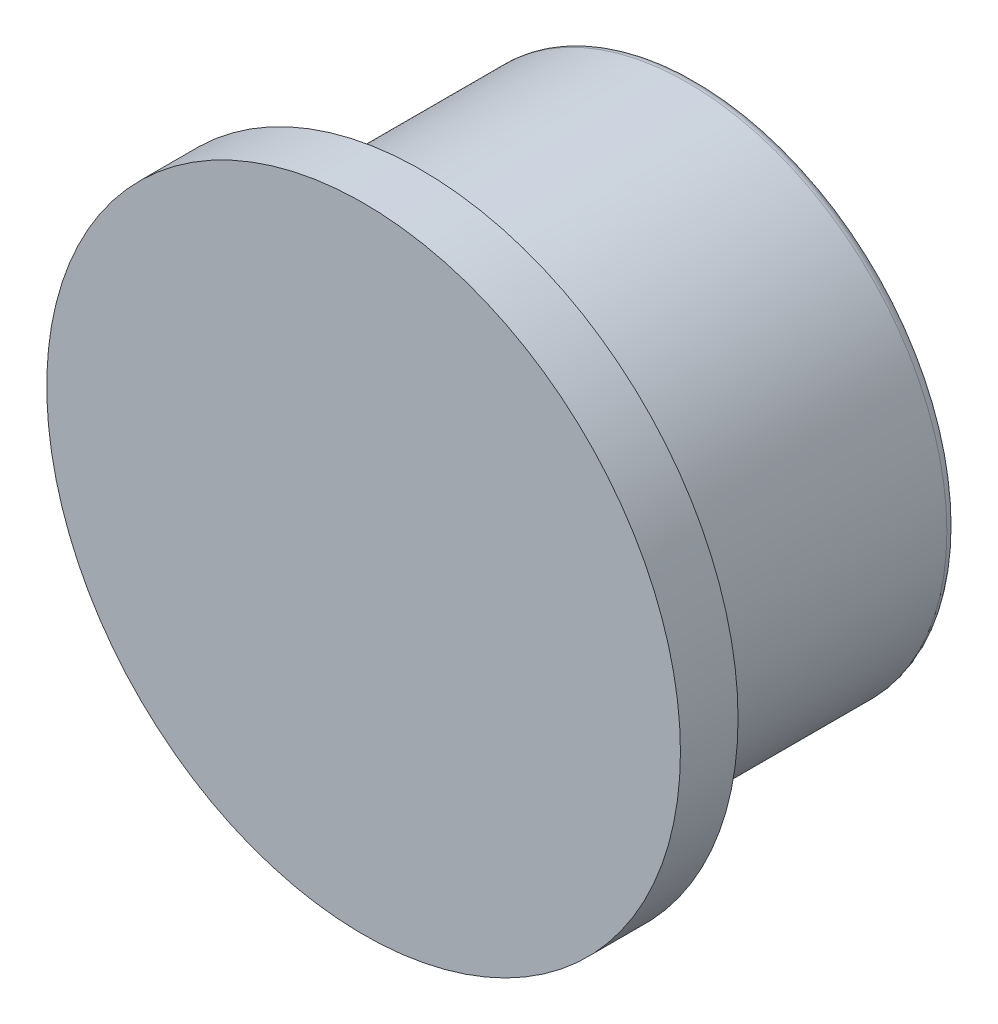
ISO-10303-21;
HEADER;
FILE_DESCRIPTION(('STEP AP214'),'2;1');
FILE_NAME('part.step','',(''),(''),'','','');
FILE_SCHEMA(('AUTOMOTIVE_DESIGN { 1 0 10303 214 1 1 1 1 }'));
ENDSEC;
DATA;
#1=APPLICATION_CONTEXT('core data for automotive mechanical design processes');
#2=APPLICATION_PROTOCOL_DEFINITION('international standard','automotive_design',2000,#1);
#3=PRODUCT_CONTEXT('',#1,'mechanical');
#4=PRODUCT('Part','Part','',(#3));
#5=PRODUCT_RELATED_PRODUCT_CATEGORY('part','',(#4));
#6=PRODUCT_DEFINITION_FORMATION('','',#4);
#7=PRODUCT_DEFINITION_CONTEXT('part definition',#1,'design');
#8=PRODUCT_DEFINITION('design','',#6,#7);
#9=PRODUCT_DEFINITION_SHAPE('','',#8);
#10=(LENGTH_UNIT() NAMED_UNIT(*) SI_UNIT(.MILLI.,.METRE.));
#11=(NAMED_UNIT(*) PLANE_ANGLE_UNIT() SI_UNIT($,.RADIAN.));
#12=(NAMED_UNIT(*) SI_UNIT($,.STERADIAN.) SOLID_ANGLE_UNIT());
#13=UNCERTAINTY_MEASURE_WITH_UNIT(LENGTH_MEASURE(1.E-05),#10,'distance_accuracy_value','');
#14=(GEOMETRIC_REPRESENTATION_CONTEXT(3) GLOBAL_UNCERTAINTY_ASSIGNED_CONTEXT((#13)) GLOBAL_UNIT_ASSIGNED_CONTEXT((#10,
#11,#12)) REPRESENTATION_CONTEXT('',''));
#15=CARTESIAN_POINT('',(0.,0.,0.));
#16=DIRECTION('',(0.,0.,1.));
#17=DIRECTION('',(1.,0.,0.));
#18=AXIS2_PLACEMENT_3D('',#15,#16,#17);
#19=CARTESIAN_POINT('',(0.,0.,0.));
#20=DIRECTION('',(0.,0.,-1.));
#21=DIRECTION('',(-1.,0.,0.));
#22=AXIS2_PLACEMENT_3D('',#19,#20,#21);
#23=PLANE('',#22);
#24=CARTESIAN_POINT('',(0.,0.,0.));
#25=DIRECTION('',(0.,0.,1.));
#26=DIRECTION('',(1.,0.,0.));
#27=AXIS2_PLACEMENT_3D('',#24,#25,#26);
#28=CIRCLE('',#27,55.);
#29=CARTESIAN_POINT('',(55.,0.,0.));
#30=VERTEX_POINT('',#29);
#31=EDGE_CURVE('E11',#30,#30,#28,.T.);
#32=ORIENTED_EDGE('',*,*,#31,.T.);
#33=EDGE_LOOP('',(#32));
#34=FACE_BOUND('',#33,.T.);
#35=ADVANCED_FACE('F34',(#34),#23,.F.);
#36=CARTESIAN_POINT('',(0.,0.,0.));
#37=DIRECTION('',(0.,0.,1.));
#38=DIRECTION('',(1.,0.,0.));
#39=AXIS2_PLACEMENT_3D('',#36,#37,#38);
#40=CYLINDRICAL_SURFACE('',#39,55.);
#41=ORIENTED_EDGE('',*,*,#31,.F.);
#42=EDGE_LOOP('',(#41));
#43=FACE_BOUND('',#42,.T.);
#44=CARTESIAN_POINT('',(0.,0.,-10.));
#45=DIRECTION('',(0.,0.,1.));
#46=DIRECTION('',(1.,0.,0.));
#47=AXIS2_PLACEMENT_3D('',#44,#45,#46);
#48=CIRCLE('',#47,55.);
#49=CARTESIAN_POINT('',(55.,0.,-10.));
#50=VERTEX_POINT('',#49);
#51=EDGE_CURVE('E40',#50,#50,#48,.T.);
#52=ORIENTED_EDGE('',*,*,#51,.T.);
#53=EDGE_LOOP('',(#52));
#54=FACE_BOUND('',#53,.T.);
#55=ADVANCED_FACE('F71',(#43,#54),#40,.T.);
#56=CARTESIAN_POINT('',(0.,55.,-10.));
#57=DIRECTION('',(0.,0.,1.));
#58=DIRECTION('',(1.,0.,0.));
#59=AXIS2_PLACEMENT_3D('',#56,#57,#58);
#60=PLANE('',#59);
#61=ORIENTED_EDGE('',*,*,#51,.F.);
#62=EDGE_LOOP('',(#61));
#63=FACE_BOUND('',#62,.T.);
#64=CARTESIAN_POINT('',(0.,0.,-10.));
#65=DIRECTION('',(0.,0.,1.));
#66=DIRECTION('',(1.,0.,0.));
#67=AXIS2_PLACEMENT_3D('',#64,#65,#66);
#68=CIRCLE('',#67,45.);
#69=CARTESIAN_POINT('',(45.,0.,-10.));
#70=VERTEX_POINT('',#69);
#71=EDGE_CURVE('E66',#70,#70,#68,.T.);
#72=ORIENTED_EDGE('',*,*,#71,.T.);
#73=EDGE_LOOP('',(#72));
#74=FACE_BOUND('',#73,.T.);
#75=ADVANCED_FACE('F73',(#63,#74),#60,.F.);
#76=CARTESIAN_POINT('',(0.,0.,0.));
#77=DIRECTION('',(0.,0.,1.));
#78=DIRECTION('',(1.,0.,0.));
#79=AXIS2_PLACEMENT_3D('',#76,#77,#78);
#80=CYLINDRICAL_SURFACE('',#79,45.);
#81=ORIENTED_EDGE('',*,*,#71,.F.);
#82=EDGE_LOOP('',(#81));
#83=FACE_BOUND('',#82,.T.);
#84=CARTESIAN_POINT('',(0.,0.,-56.25));
#85=DIRECTION('',(0.,0.,1.));
#86=DIRECTION('',(1.,0.,0.));
#87=AXIS2_PLACEMENT_3D('',#84,#85,#86);
#88=CIRCLE('',#87,45.);
#89=CARTESIAN_POINT('',(45.,0.,-56.25));
#90=VERTEX_POINT('',#89);
#91=EDGE_CURVE('E57',#90,#90,#88,.T.);
#92=ORIENTED_EDGE('',*,*,#91,.T.);
#93=EDGE_LOOP('',(#92));
#94=FACE_BOUND('',#93,.T.);
#95=ADVANCED_FACE('F76',(#83,#94),#80,.T.);
#96=CARTESIAN_POINT('',(0.,0.,-56.25));
#97=DIRECTION('',(0.,0.,1.));
#98=DIRECTION('',(1.,0.,0.));
#99=AXIS2_PLACEMENT_3D('',#96,#97,#98);
#100=TOROIDAL_SURFACE('',#99,43.25,1.75);
#101=ORIENTED_EDGE('',*,*,#91,.F.);
#102=EDGE_LOOP('',(#101));
#103=FACE_BOUND('',#102,.T.);
#104=CARTESIAN_POINT('',(0.,0.,-58.));
#105=DIRECTION('',(0.,0.,1.));
#106=DIRECTION('',(1.,0.,0.));
#107=AXIS2_PLACEMENT_3D('',#104,#105,#106);
#108=CIRCLE('',#107,43.25);
#109=CARTESIAN_POINT('',(43.25,0.,-58.));
#110=VERTEX_POINT('',#109);
#111=EDGE_CURVE('E53',#110,#110,#108,.T.);
#112=ORIENTED_EDGE('',*,*,#111,.T.);
#113=EDGE_LOOP('',(#112));
#114=FACE_BOUND('',#113,.T.);
#115=ADVANCED_FACE('F82',(#103,#114),#100,.T.);
#116=CARTESIAN_POINT('',(0.,43.25,-58.));
#117=DIRECTION('',(0.,0.,1.));
#118=DIRECTION('',(1.,0.,0.));
#119=AXIS2_PLACEMENT_3D('',#116,#117,#118);
#120=PLANE('',#119);
#121=CARTESIAN_POINT('',(0.,0.,-58.));
#122=DIRECTION('',(0.,0.,-1.));
#123=DIRECTION('',(-1.,0.,0.));
#124=AXIS2_PLACEMENT_3D('',#121,#122,#123);
#125=CIRCLE('',#124,4.025);
#126=CARTESIAN_POINT('',(-4.025,0.,-58.));
#127=VERTEX_POINT('',#126);
#128=EDGE_CURVE('E60',#127,#127,#125,.T.);
#129=ORIENTED_EDGE('',*,*,#128,.F.);
#130=EDGE_LOOP('',(#129));
#131=FACE_BOUND('',#130,.T.);
#132=ORIENTED_EDGE('',*,*,#111,.F.);
#133=EDGE_LOOP('',(#132));
#134=FACE_BOUND('',#133,.T.);
#135=ADVANCED_FACE('F47',(#131,#134),#120,.F.);
#136=CARTESIAN_POINT('',(0.,0.,-42.));
#137=DIRECTION('',(0.,0.,-1.));
#138=DIRECTION('',(-1.,0.,0.));
#139=AXIS2_PLACEMENT_3D('',#136,#137,#138);
#140=CONICAL_SURFACE('',#139,3.5,1.02974425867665);
#141=CARTESIAN_POINT('',(0.,0.,-39.8969878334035));
#142=VERTEX_POINT('',#141);
#143=VERTEX_LOOP('',#142);
#144=FACE_BOUND('',#143,.T.);
#145=CARTESIAN_POINT('',(0.,0.,-42.));
#146=DIRECTION('',(0.,0.,-1.));
#147=DIRECTION('',(-1.,0.,0.));
#148=AXIS2_PLACEMENT_3D('',#145,#146,#147);
#149=CIRCLE('',#148,3.5);
#150=CARTESIAN_POINT('',(-3.5,0.,-42.));
#151=VERTEX_POINT('',#150);
#152=EDGE_CURVE('E51',#151,#151,#149,.T.);
#153=ORIENTED_EDGE('',*,*,#152,.T.);
#154=EDGE_LOOP('',(#153));
#155=FACE_BOUND('',#154,.T.);
#156=ADVANCED_FACE('F43',(#144,#155),#140,.F.);
#157=CARTESIAN_POINT('',(0.,0.,-58.));
#158=DIRECTION('',(0.,0.,-1.));
#159=DIRECTION('',(-1.,0.,0.));
#160=AXIS2_PLACEMENT_3D('',#157,#158,#159);
#161=CYLINDRICAL_SURFACE('',#160,3.5);
#162=ORIENTED_EDGE('',*,*,#152,.F.);
#163=EDGE_LOOP('',(#162));
#164=FACE_BOUND('',#163,.T.);
#165=CARTESIAN_POINT('',(0.,0.,-57.475));
#166=DIRECTION('',(0.,0.,-1.));
#167=DIRECTION('',(-1.,0.,0.));
#168=AXIS2_PLACEMENT_3D('',#165,#166,#167);
#169=CIRCLE('',#168,3.5);
#170=CARTESIAN_POINT('',(-3.5,0.,-57.475));
#171=VERTEX_POINT('',#170);
#172=EDGE_CURVE('E54',#171,#171,#169,.T.);
#173=ORIENTED_EDGE('',*,*,#172,.T.);
#174=EDGE_LOOP('',(#173));
#175=FACE_BOUND('',#174,.T.);
#176=ADVANCED_FACE('F46',(#164,#175),#161,.F.);
#177=CARTESIAN_POINT('',(0.,0.,-58.));
#178=DIRECTION('',(0.,0.,-1.));
#179=DIRECTION('',(-1.,0.,0.));
#180=AXIS2_PLACEMENT_3D('',#177,#178,#179);
#181=CONICAL_SURFACE('',#180,4.025,0.785398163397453);
#182=ORIENTED_EDGE('',*,*,#172,.F.);
#183=EDGE_LOOP('',(#182));
#184=FACE_BOUND('',#183,.T.);
#185=ORIENTED_EDGE('',*,*,#128,.T.);
#186=EDGE_LOOP('',(#185));
#187=FACE_BOUND('',#186,.T.);
#188=ADVANCED_FACE('F137',(#184,#187),#181,.F.);
#189=CLOSED_SHELL('',(#35,#55,#75,#95,#115,#135,#156,#176,#188));
#190=MANIFOLD_SOLID_BREP('B2',#189);
#191=ADVANCED_BREP_SHAPE_REPRESENTATION('',(#18,#190),#14);
#192=SHAPE_DEFINITION_REPRESENTATION(#9,#191);
ENDSEC;
END-ISO-10303-21;
